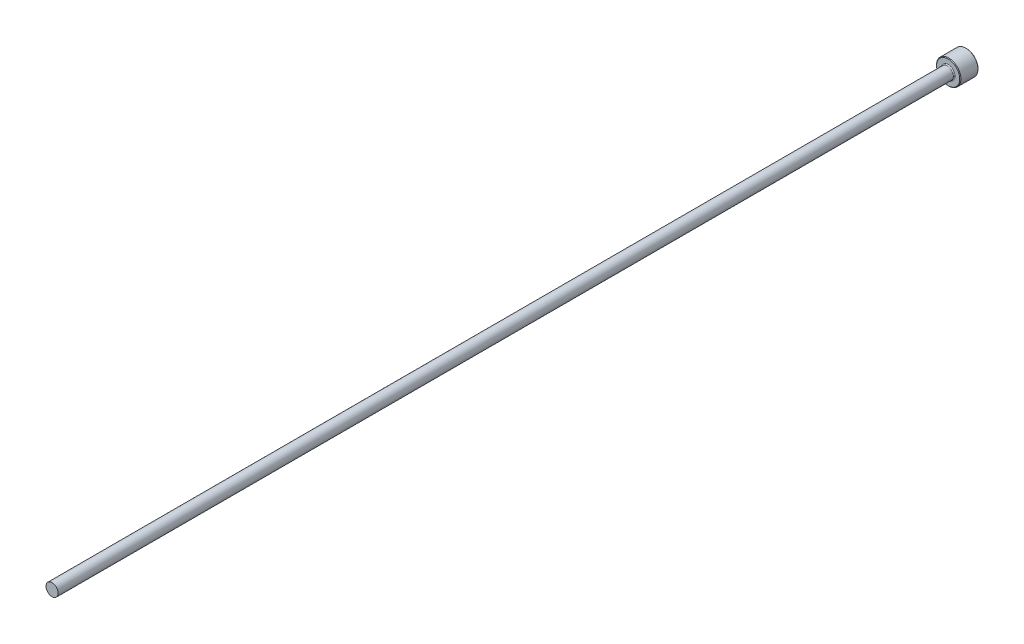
ISO-10303-21;
HEADER;
FILE_DESCRIPTION(('STEP AP214'),'2;1');
FILE_NAME('part.step','',(''),(''),'','','');
FILE_SCHEMA(('AUTOMOTIVE_DESIGN { 1 0 10303 214 1 1 1 1 }'));
ENDSEC;
DATA;
#1=APPLICATION_CONTEXT('core data for automotive mechanical design processes');
#2=APPLICATION_PROTOCOL_DEFINITION('international standard','automotive_design',2000,#1);
#3=PRODUCT_CONTEXT('',#1,'mechanical');
#4=PRODUCT('Part','Part','',(#3));
#5=PRODUCT_RELATED_PRODUCT_CATEGORY('part','',(#4));
#6=PRODUCT_DEFINITION_FORMATION('','',#4);
#7=PRODUCT_DEFINITION_CONTEXT('part definition',#1,'design');
#8=PRODUCT_DEFINITION('design','',#6,#7);
#9=PRODUCT_DEFINITION_SHAPE('','',#8);
#10=(LENGTH_UNIT() NAMED_UNIT(*) SI_UNIT(.MILLI.,.METRE.));
#11=(NAMED_UNIT(*) PLANE_ANGLE_UNIT() SI_UNIT($,.RADIAN.));
#12=(NAMED_UNIT(*) SI_UNIT($,.STERADIAN.) SOLID_ANGLE_UNIT());
#13=UNCERTAINTY_MEASURE_WITH_UNIT(LENGTH_MEASURE(1.E-05),#10,'distance_accuracy_value','');
#14=(GEOMETRIC_REPRESENTATION_CONTEXT(3) GLOBAL_UNCERTAINTY_ASSIGNED_CONTEXT((#13)) GLOBAL_UNIT_ASSIGNED_CONTEXT((#10,
#11,#12)) REPRESENTATION_CONTEXT('',''));
#15=CARTESIAN_POINT('',(0.,0.,0.));
#16=DIRECTION('',(0.,0.,1.));
#17=DIRECTION('',(1.,0.,0.));
#18=AXIS2_PLACEMENT_3D('',#15,#16,#17);
#19=CARTESIAN_POINT('',(0.,1.99999999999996,300.));
#20=DIRECTION('',(0.,0.,-1.));
#21=DIRECTION('',(-1.,0.,0.));
#22=AXIS2_PLACEMENT_3D('',#19,#20,#21);
#23=PLANE('',#22);
#24=CARTESIAN_POINT('',(0.,0.,300.));
#25=DIRECTION('',(0.,0.,1.));
#26=DIRECTION('',(1.,0.,0.));
#27=AXIS2_PLACEMENT_3D('',#24,#25,#26);
#28=CIRCLE('',#27,1.99999999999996);
#29=CARTESIAN_POINT('',(1.99999999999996,0.,300.));
#30=VERTEX_POINT('',#29);
#31=EDGE_CURVE('E50',#30,#30,#28,.T.);
#32=ORIENTED_EDGE('',*,*,#31,.T.);
#33=EDGE_LOOP('',(#32));
#34=FACE_BOUND('',#33,.T.);
#35=ADVANCED_FACE('F30',(#34),#23,.F.);
#36=CARTESIAN_POINT('',(0.,0.,109.050628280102));
#37=DIRECTION('',(0.,0.,1.));
#38=DIRECTION('',(1.,0.,0.));
#39=AXIS2_PLACEMENT_3D('',#36,#37,#38);
#40=CYLINDRICAL_SURFACE('',#39,1.99999999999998);
#41=ORIENTED_EDGE('',*,*,#31,.F.);
#42=EDGE_LOOP('',(#41));
#43=FACE_BOUND('',#42,.T.);
#44=CARTESIAN_POINT('',(0.,0.,6.3));
#45=DIRECTION('',(0.,0.,1.));
#46=DIRECTION('',(1.,0.,0.));
#47=AXIS2_PLACEMENT_3D('',#44,#45,#46);
#48=CIRCLE('',#47,2.);
#49=CARTESIAN_POINT('',(2.,0.,6.3));
#50=VERTEX_POINT('',#49);
#51=EDGE_CURVE('E53',#50,#50,#48,.T.);
#52=ORIENTED_EDGE('',*,*,#51,.T.);
#53=EDGE_LOOP('',(#52));
#54=FACE_BOUND('',#53,.T.);
#55=ADVANCED_FACE('F73',(#43,#54),#40,.T.);
#56=CARTESIAN_POINT('',(0.,0.,6.3));
#57=DIRECTION('',(0.,0.,1.));
#58=DIRECTION('',(1.,0.,0.));
#59=AXIS2_PLACEMENT_3D('',#56,#57,#58);
#60=TOROIDAL_SURFACE('',#59,2.3,0.3);
#61=ORIENTED_EDGE('',*,*,#51,.F.);
#62=EDGE_LOOP('',(#61));
#63=FACE_BOUND('',#62,.T.);
#64=CARTESIAN_POINT('',(0.,0.,6.00000000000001));
#65=DIRECTION('',(0.,0.,1.));
#66=DIRECTION('',(1.,0.,0.));
#67=AXIS2_PLACEMENT_3D('',#64,#65,#66);
#68=CIRCLE('',#67,2.3);
#69=CARTESIAN_POINT('',(2.3,0.,6.00000000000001));
#70=VERTEX_POINT('',#69);
#71=EDGE_CURVE('E56',#70,#70,#68,.T.);
#72=ORIENTED_EDGE('',*,*,#71,.T.);
#73=EDGE_LOOP('',(#72));
#74=FACE_BOUND('',#73,.T.);
#75=ADVANCED_FACE('F60',(#63,#74),#60,.F.);
#76=CARTESIAN_POINT('',(0.,4.,6.));
#77=DIRECTION('',(0.,0.,-1.));
#78=DIRECTION('',(-1.,0.,0.));
#79=AXIS2_PLACEMENT_3D('',#76,#77,#78);
#80=PLANE('',#79);
#81=CARTESIAN_POINT('',(0.,0.,6.));
#82=DIRECTION('',(0.,0.,-1.));
#83=DIRECTION('',(-1.,0.,0.));
#84=AXIS2_PLACEMENT_3D('',#81,#82,#83);
#85=CIRCLE('',#84,3.80000000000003);
#86=CARTESIAN_POINT('',(-3.80000000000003,0.,6.));
#87=VERTEX_POINT('',#86);
#88=EDGE_CURVE('E10',#87,#87,#85,.F.);
#89=ORIENTED_EDGE('',*,*,#88,.T.);
#90=EDGE_LOOP('',(#89));
#91=FACE_BOUND('',#90,.T.);
#92=ORIENTED_EDGE('',*,*,#71,.F.);
#93=EDGE_LOOP('',(#92));
#94=FACE_BOUND('',#93,.T.);
#95=ADVANCED_FACE('F62',(#91,#94),#80,.F.);
#96=CARTESIAN_POINT('',(0.,0.,109.050628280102));
#97=DIRECTION('',(0.,0.,1.));
#98=DIRECTION('',(1.,0.,0.));
#99=AXIS2_PLACEMENT_3D('',#96,#97,#98);
#100=CYLINDRICAL_SURFACE('',#99,4.);
#101=CARTESIAN_POINT('',(0.,0.,0.200000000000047));
#102=DIRECTION('',(0.,0.,1.));
#103=DIRECTION('',(1.,0.,0.));
#104=AXIS2_PLACEMENT_3D('',#101,#102,#103);
#105=CIRCLE('',#104,4.);
#106=CARTESIAN_POINT('',(4.,0.,0.200000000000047));
#107=VERTEX_POINT('',#106);
#108=EDGE_CURVE('E41',#107,#107,#105,.T.);
#109=ORIENTED_EDGE('',*,*,#108,.T.);
#110=EDGE_LOOP('',(#109));
#111=FACE_BOUND('',#110,.T.);
#112=CARTESIAN_POINT('',(0.,0.,5.8));
#113=DIRECTION('',(0.,0.,-1.));
#114=DIRECTION('',(-1.,0.,0.));
#115=AXIS2_PLACEMENT_3D('',#112,#113,#114);
#116=CIRCLE('',#115,4.);
#117=CARTESIAN_POINT('',(-4.,0.,5.8));
#118=VERTEX_POINT('',#117);
#119=EDGE_CURVE('E45',#118,#118,#116,.T.);
#120=ORIENTED_EDGE('',*,*,#119,.T.);
#121=EDGE_LOOP('',(#120));
#122=FACE_BOUND('',#121,.T.);
#123=ADVANCED_FACE('F64',(#111,#122),#100,.T.);
#124=CARTESIAN_POINT('',(0.,0.,0.));
#125=DIRECTION('',(0.,0.,1.));
#126=DIRECTION('',(1.,0.,0.));
#127=AXIS2_PLACEMENT_3D('',#124,#125,#126);
#128=PLANE('',#127);
#129=CARTESIAN_POINT('',(0.,0.,0.));
#130=DIRECTION('',(0.,0.,1.));
#131=DIRECTION('',(1.,0.,0.));
#132=AXIS2_PLACEMENT_3D('',#129,#130,#131);
#133=CIRCLE('',#132,3.8);
#134=CARTESIAN_POINT('',(3.8,0.,0.));
#135=VERTEX_POINT('',#134);
#136=EDGE_CURVE('E37',#135,#135,#133,.F.);
#137=ORIENTED_EDGE('',*,*,#136,.T.);
#138=EDGE_LOOP('',(#137));
#139=FACE_BOUND('',#138,.T.);
#140=ADVANCED_FACE('F70',(#139),#128,.F.);
#141=CARTESIAN_POINT('',(0.,0.,0.200000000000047));
#142=DIRECTION('',(0.,0.,1.));
#143=DIRECTION('',(1.,0.,0.));
#144=AXIS2_PLACEMENT_3D('',#141,#142,#143);
#145=CONICAL_SURFACE('',#144,4.,0.785398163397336);
#146=ORIENTED_EDGE('',*,*,#136,.F.);
#147=EDGE_LOOP('',(#146));
#148=FACE_BOUND('',#147,.T.);
#149=ORIENTED_EDGE('',*,*,#108,.F.);
#150=EDGE_LOOP('',(#149));
#151=FACE_BOUND('',#150,.T.);
#152=ADVANCED_FACE('F84',(#148,#151),#145,.T.);
#153=CARTESIAN_POINT('',(0.,0.,6.00000000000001));
#154=DIRECTION('',(0.,0.,-1.));
#155=DIRECTION('',(-1.,0.,0.));
#156=AXIS2_PLACEMENT_3D('',#153,#154,#155);
#157=CONICAL_SURFACE('',#156,3.80000000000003,0.78539816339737);
#158=ORIENTED_EDGE('',*,*,#119,.F.);
#159=EDGE_LOOP('',(#158));
#160=FACE_BOUND('',#159,.T.);
#161=ORIENTED_EDGE('',*,*,#88,.F.);
#162=EDGE_LOOP('',(#161));
#163=FACE_BOUND('',#162,.T.);
#164=ADVANCED_FACE('F32',(#160,#163),#157,.T.);
#165=CLOSED_SHELL('',(#35,#55,#75,#95,#123,#140,#152,#164));
#166=MANIFOLD_SOLID_BREP('B2',#165);
#167=ADVANCED_BREP_SHAPE_REPRESENTATION('',(#18,#166),#14);
#168=SHAPE_DEFINITION_REPRESENTATION(#9,#167);
ENDSEC;
END-ISO-10303-21;
